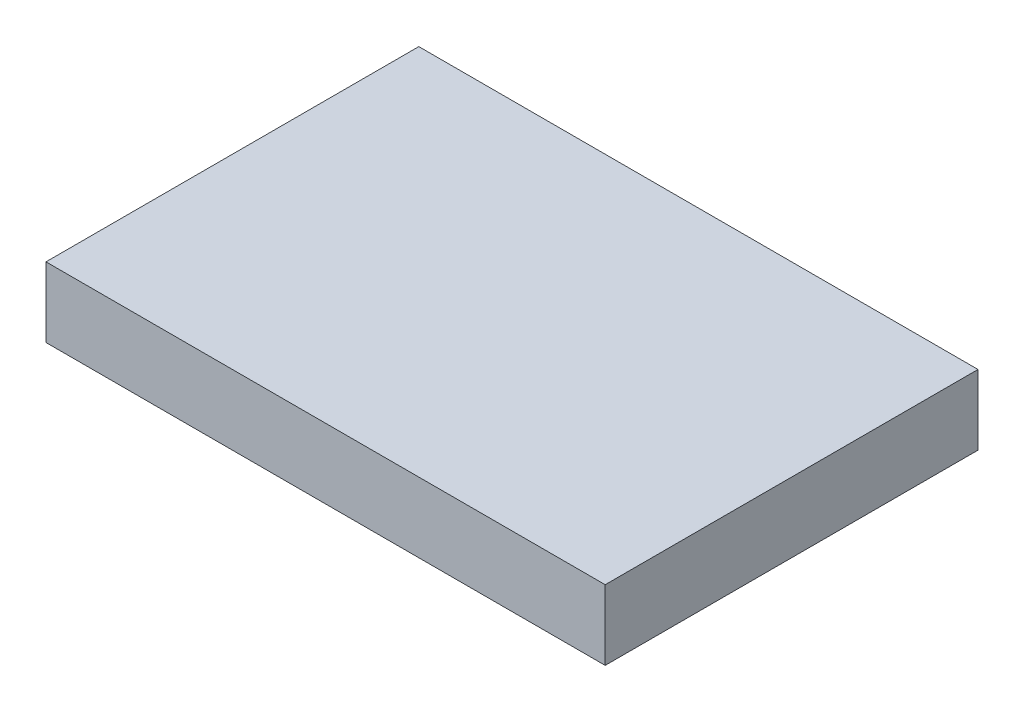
from build123d import *

# Parameters (mm, degrees)
SKETCH1_W      = 152.4
SKETCH1_H      = 101.6
EXTRUDE1_DEPTH = 19.05


with BuildPart() as part:
    # Sketch1 → Extrude1 (new body)
    with BuildSketch(Plane(origin=(0, 0, 0), x_dir=(1, 0, 0), z_dir=(0, 1, 0))):
        with Locations((76.2, 50.8)):
            Rectangle(SKETCH1_W, SKETCH1_H)
    extrude(amount=EXTRUDE1_DEPTH)


solid = part.part
